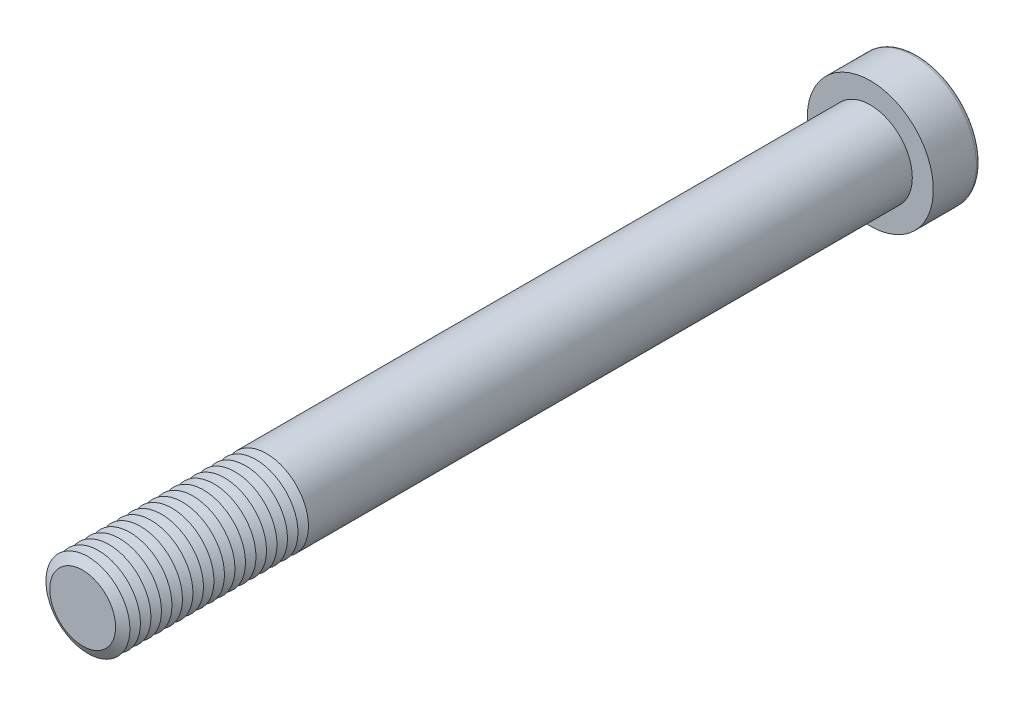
from build123d import *

# Parameters (mm, degrees)
SKETCH1_R           = 8
BOSS_EXTRUDE1_DEPTH = 150
SKETCH2_R           = 12
BOSS_EXTRUDE2_DEPTH = 9
CUT_EXTRUDE1_DEPTH  = 9
FILLET1_R           = 0.8
LPATTERN1_COUNT     = 18
LPATTERN1_PITCH     = 2


with BuildPart() as part:
    # Sketch1 → Boss-Extrude1 (new body)
    with BuildSketch(Plane.XY):
        Circle(SKETCH1_R)
    extrude(amount=BOSS_EXTRUDE1_DEPTH)

    # Sketch2 → Boss-Extrude2 (add)
    with BuildSketch(Plane(origin=(0, 0, 0), x_dir=(-1, 0, 0), z_dir=(0, 0, -1))):
        Circle(SKETCH2_R)
    extrude(amount=BOSS_EXTRUDE2_DEPTH)

    # Sketch3 → Cut-Extrude1 (cut)
    with BuildSketch(Plane(origin=(0, 0, -9), x_dir=(-1, 0, 0), z_dir=(0, 0, -1))):
        Polygon((-3.464101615, 6), (-6.92820323, 0), (-3.464101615, -6), (3.464101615, -6), (6.92820323, 0), (3.464101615, 6), align=None)
    extrude(amount=-CUT_EXTRUDE1_DEPTH, mode=Mode.SUBTRACT)

    # Fillet1
    fillet1_edges = [part.edges().sort_by_distance(p)[0] for p in [
        (12, 0, -9),
    ]]
    fillet(fillet1_edges, radius=FILLET1_R)

    # Cut-Extrude2 cone 1 section (on through the dimple's axis) → Cut-Extrude2 (revolve, cut)
    with BuildSketch(Plane.YZ):
        Polygon((0, 0), (6, 0), (0, 3.464101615), align=None)
    revolve(axis=Axis((0, 0, 0), (0, 0, 1)), mode=Mode.SUBTRACT)

    # Cut-Extrude3 cone 1 section (on through the dimple's axis) → Cut-Extrude3 (revolve, cut)
    with BuildSketch(Plane(origin=(0, 0, -9), x_dir=(0, 1, 0), z_dir=(1, 0, 0))):
        Polygon((0, 0), (6.92820323, 0), (0, 1.856406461), align=None)
    revolve(axis=Axis((0, 0, -9), (0, 0, 1)), mode=Mode.SUBTRACT)

    # Sketch7 → Cut-Revolve1 (revolve, cut)
    with BuildSketch(Plane(origin=(0, 0, 0), x_dir=(0, 0, -1), z_dir=(1, 0, 0)), mode=Mode.PRIVATE) as cut_revolve1_sk:
        Polygon((-150, 6.267949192), (-149, 8), (-151, 8), align=None)
    cut_revolve1 = revolve(cut_revolve1_sk.sketch.rotate(Axis((0, 0, 150), (0, 0, -1)), 90), axis=Axis((0, 0, 150), (0, 0, -1)), mode=Mode.SUBTRACT)

    # LPattern1: Cut-Revolve1 ×18
    with Locations(*[(0, 0, -i * LPATTERN1_PITCH) for i in range(1, LPATTERN1_COUNT)]):
        add(cut_revolve1, mode=Mode.SUBTRACT)


solid = part.part
